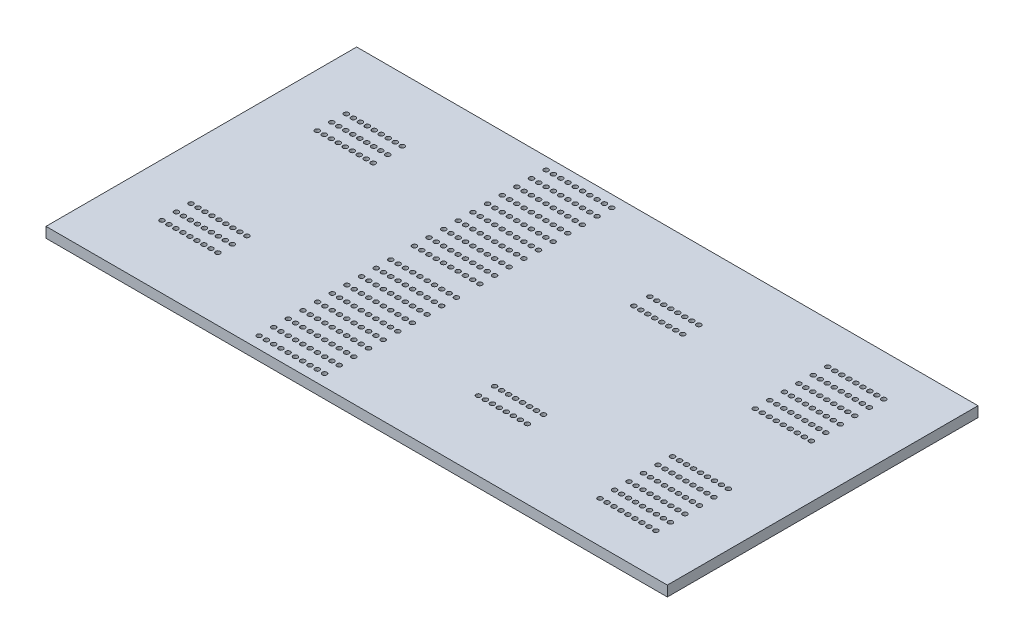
from build123d import *

# Parameters (mm, degrees)
ESQUISSE2_W                     = 120
ESQUISSE2_H                     = 30
BOSS_EXTRU_1_DEPTH              = 2
ENL_V_MAT_EXTRU_3_REACH         = 63.879
ESQUISSE8_R                     = 0.45
R_P_TITION_LIN_AIRE4_COUNT      = 9
R_P_TITION_LIN_AIRE4_PITCH      = 1.35
R_P_TITION_LIN_AIRE4_COUNT_DIR2 = 3
R_P_TITION_LIN_AIRE4_PITCH_DIR2 = 2.8
ENL_V_MAT_EXTRU_4_REACH         = 63.879
ESQUISSE10_R                    = 0.45
R_P_TITION_LIN_AIRE5_COUNT      = 10
R_P_TITION_LIN_AIRE5_PITCH      = 1.406
R_P_TITION_LIN_AIRE5_COUNT_DIR2 = 10
R_P_TITION_LIN_AIRE5_PITCH_DIR2 = 2.827777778
ENL_V_MAT_EXTRU_5_REACH         = 63.879
ESQUISSE12_R                    = 0.45
R_P_TITION_LIN_AIRE6_COUNT      = 8
R_P_TITION_LIN_AIRE6_PITCH      = 1.35
R_P_TITION_LIN_AIRE6_COUNT_DIR2 = 2
R_P_TITION_LIN_AIRE6_PITCH_DIR2 = 3.111
ENL_V_MAT_EXTRU_6_REACH         = 63.879
ESQUISSE14_R                    = 0.45
R_P_TITION_LIN_AIRE7_COUNT      = 9
R_P_TITION_LIN_AIRE7_PITCH      = 1.35
R_P_TITION_LIN_AIRE7_COUNT_DIR2 = 6
R_P_TITION_LIN_AIRE7_PITCH_DIR2 = 2.8


with BuildPart() as part:
    # Esquisse2 → Boss.-Extru.1 (new body)
    with BuildSketch(Plane(origin=(0, 0, 0), x_dir=(1, 0, 0), z_dir=(0, 1, 0))):
        Rectangle(ESQUISSE2_W, ESQUISSE2_H)
    extrude(amount=BOSS_EXTRU_1_DEPTH)

    # Esquisse8 → Enl_v. mat.-Extru.3 (cut, up to next)
    with BuildSketch(Plane(origin=(0, 2, 0), x_dir=(1, 0, 0), z_dir=(0, 1, 0)), mode=Mode.PRIVATE) as enl_v_mat_extru_3_sk1:
        with Locations(Location((-49.8, 2.8, 0), (0, 0, 270))):
            Circle(ESQUISSE8_R)
    enl_v_mat_extru_3_tool1 = extrude(enl_v_mat_extru_3_sk1.sketch, amount=-ENL_V_MAT_EXTRU_3_REACH, mode=Mode.PRIVATE) & part.part
    enl_v_mat_extru_3 = enl_v_mat_extru_3_tool1.solids().sort_by_distance((-49.8, 2, -2.8))[0]
    add(enl_v_mat_extru_3, mode=Mode.SUBTRACT)

    # R_p_tition lin_aire4: Enl_v. mat.-Extru.3 9 × 3
    with Locations(*[(i * R_P_TITION_LIN_AIRE4_PITCH, 0, j * R_P_TITION_LIN_AIRE4_PITCH_DIR2) for i in range(R_P_TITION_LIN_AIRE4_COUNT) for j in range(R_P_TITION_LIN_AIRE4_COUNT_DIR2) if (i, j) != (0, 0)]):
        add(enl_v_mat_extru_3, mode=Mode.SUBTRACT)

    # Esquisse10 → Enl_v. mat.-Extru.4 (cut, up to next)
    with BuildSketch(Plane(origin=(0, 2, 0), x_dir=(1, 0, 0), z_dir=(0, 1, 0)), mode=Mode.PRIVATE) as enl_v_mat_extru_4_sk1:
        with Locations(Location((-21.127, 12.725, 0), (0, 0, 270))):
            Circle(ESQUISSE10_R)
    enl_v_mat_extru_4_tool1 = extrude(enl_v_mat_extru_4_sk1.sketch, amount=-ENL_V_MAT_EXTRU_4_REACH, mode=Mode.PRIVATE) & part.part
    enl_v_mat_extru_4 = enl_v_mat_extru_4_tool1.solids().sort_by_distance((-21.127, 2, -12.725))[0]
    add(enl_v_mat_extru_4, mode=Mode.SUBTRACT)

    # R_p_tition lin_aire5: Enl_v. mat.-Extru.4 10 × 10
    with Locations(*[(i * R_P_TITION_LIN_AIRE5_PITCH, 0, j * R_P_TITION_LIN_AIRE5_PITCH_DIR2) for i in range(R_P_TITION_LIN_AIRE5_COUNT) for j in range(R_P_TITION_LIN_AIRE5_COUNT_DIR2) if (i, j) != (0, 0)]):
        add(enl_v_mat_extru_4, mode=Mode.SUBTRACT)

    # Esquisse12 → Enl_v. mat.-Extru.5 (cut, up to next)
    with BuildSketch(Plane(origin=(0, 2, 0), x_dir=(1, 0, 0), z_dir=(0, 1, 0)), mode=Mode.PRIVATE) as enl_v_mat_extru_5_sk1:
        with Locations(Location((10.075, 1.5555, 0), (0, 0, 270))):
            Circle(ESQUISSE12_R)
    enl_v_mat_extru_5_tool1 = extrude(enl_v_mat_extru_5_sk1.sketch, amount=-ENL_V_MAT_EXTRU_5_REACH, mode=Mode.PRIVATE) & part.part
    enl_v_mat_extru_5 = enl_v_mat_extru_5_tool1.solids().sort_by_distance((10.075, 2, -1.5555))[0]
    add(enl_v_mat_extru_5, mode=Mode.SUBTRACT)

    # R_p_tition lin_aire6: Enl_v. mat.-Extru.5 8 × 2
    with Locations(*[(i * R_P_TITION_LIN_AIRE6_PITCH, 0, j * R_P_TITION_LIN_AIRE6_PITCH_DIR2) for i in range(R_P_TITION_LIN_AIRE6_COUNT) for j in range(R_P_TITION_LIN_AIRE6_COUNT_DIR2) if (i, j) != (0, 0)]):
        add(enl_v_mat_extru_5, mode=Mode.SUBTRACT)

    # Esquisse14 → Enl_v. mat.-Extru.6 (cut, up to next)
    with BuildSketch(Plane(origin=(0, 2, 0), x_dir=(1, 0, 0), z_dir=(0, 1, 0)), mode=Mode.PRIVATE) as enl_v_mat_extru_6_sk1:
        with Locations(Location((39, 7, 0), (0, 0, 270))):
            Circle(ESQUISSE14_R)
    enl_v_mat_extru_6_tool1 = extrude(enl_v_mat_extru_6_sk1.sketch, amount=-ENL_V_MAT_EXTRU_6_REACH, mode=Mode.PRIVATE) & part.part
    enl_v_mat_extru_6 = enl_v_mat_extru_6_tool1.solids().sort_by_distance((39, 2, -7))[0]
    add(enl_v_mat_extru_6, mode=Mode.SUBTRACT)

    # R_p_tition lin_aire7: Enl_v. mat.-Extru.6 9 × 6
    with Locations(*[(i * R_P_TITION_LIN_AIRE7_PITCH, 0, j * R_P_TITION_LIN_AIRE7_PITCH_DIR2) for i in range(R_P_TITION_LIN_AIRE7_COUNT) for j in range(R_P_TITION_LIN_AIRE7_COUNT_DIR2) if (i, j) != (0, 0)]):
        add(enl_v_mat_extru_6, mode=Mode.SUBTRACT)

    # Sym_trie1: part across plane


with BuildPart() as part_1:
    add(part.part)
    add(part.part.mirror(Plane(origin=(-60, 2, 15), x_dir=(1, 0, 0), z_dir=(0, 0, -1))))


solid = part_1.part
